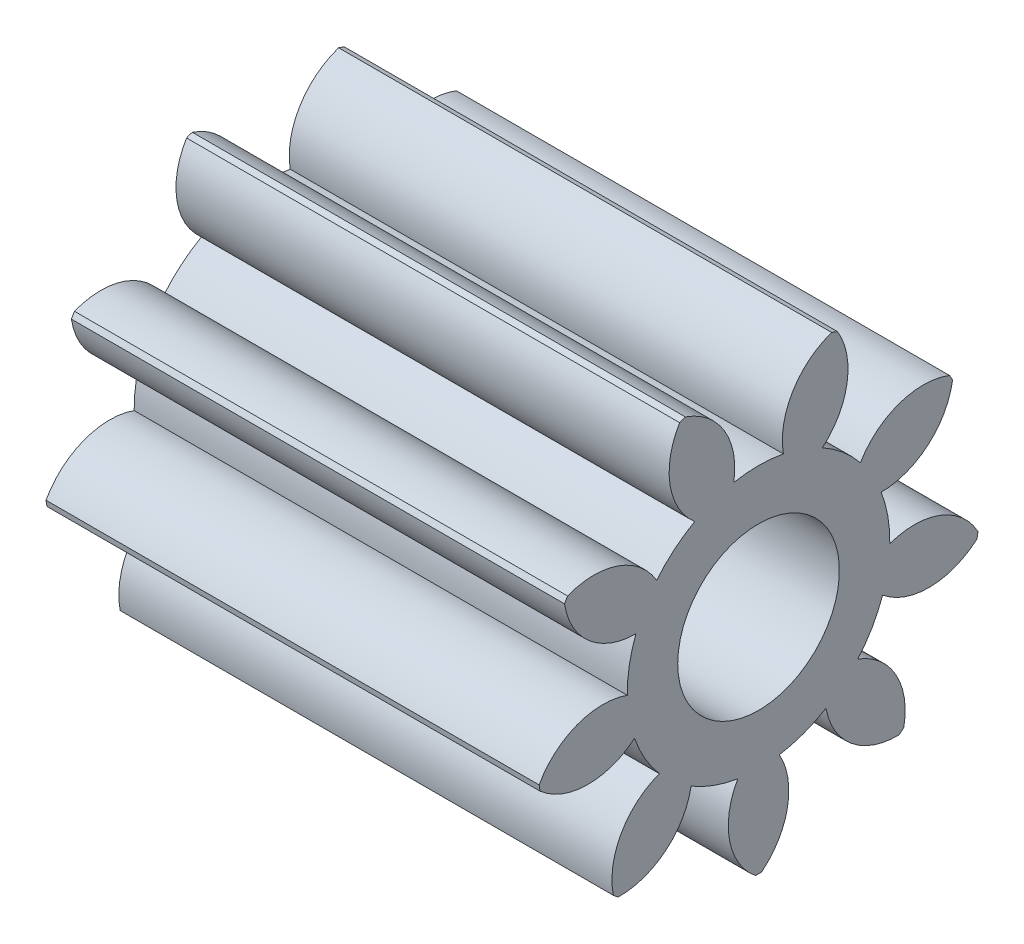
from build123d import *

# Parameters (mm, degrees)
BASPROSKE_W     = 6.1
BASPROSKE_H     = 2.75
TOOTHCUT_DEPTH  = 8.234293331
TEETHCUTS_COUNT = 9
BORSKE_R        = 1
BORE_DEPTH      = 50.0000508


with BuildPart() as part:
    # BasProSke → Base-Revolve (revolve)
    with BuildSketch(Plane(origin=(0, 0, 0), x_dir=(1, 0, 0), z_dir=(0, 1, 0)), mode=Mode.PRIVATE) as base_revolve_sk:
        with Locations((3.05, 1.375)):
            Rectangle(BASPROSKE_W, BASPROSKE_H)
    revolve(base_revolve_sk.sketch.rotate(Axis((-10, 0, 0), (1, 0, 0)), 180), axis=Axis((-10, 0, 0), (1, 0, 0)))

    # TooCutSke → ToothCut (cut, through all)
    with BuildSketch(Plane(origin=(0, 0, 0), x_dir=(0, 0, -1), z_dir=(1, 0, 0))):
        with BuildLine():
            ThreePointArc((0.306960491, 1.594726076), (0, 1.624), (-0.306960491, 1.594726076))
            ThreePointArc((-0.306960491, 1.594726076), (-0.432575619, 2.223839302), (-0.945269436, 2.609465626))
            ThreePointArc((-0.945269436, 2.609465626), (0, 2.7754), (0.945269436, 2.609465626))
            ThreePointArc((0.945269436, 2.609465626), (0.432575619, 2.223839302), (0.306960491, 1.594726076))
        make_face()
    toothcut = extrude(amount=TOOTHCUT_DEPTH, mode=Mode.SUBTRACT)

    # TeethCuts: ToothCut ×9 about axis
    teethcuts_axis = Axis((0, 0, 0), (1, 0, 0))
    for i in range(1, TEETHCUTS_COUNT):
        add(toothcut.rotate(teethcuts_axis, i * 360 / TEETHCUTS_COUNT), mode=Mode.SUBTRACT)

    # BorSke → Bore (cut, symmetric)
    with BuildSketch(Plane(origin=(0, 0, 0), x_dir=(0, 0, -1), z_dir=(1, 0, 0))):
        with Locations(Location((0, 0, 0), (0, 0, 180))):
            Circle(BORSKE_R)
    extrude(amount=BORE_DEPTH, both=True, mode=Mode.SUBTRACT)


solid = part.part
